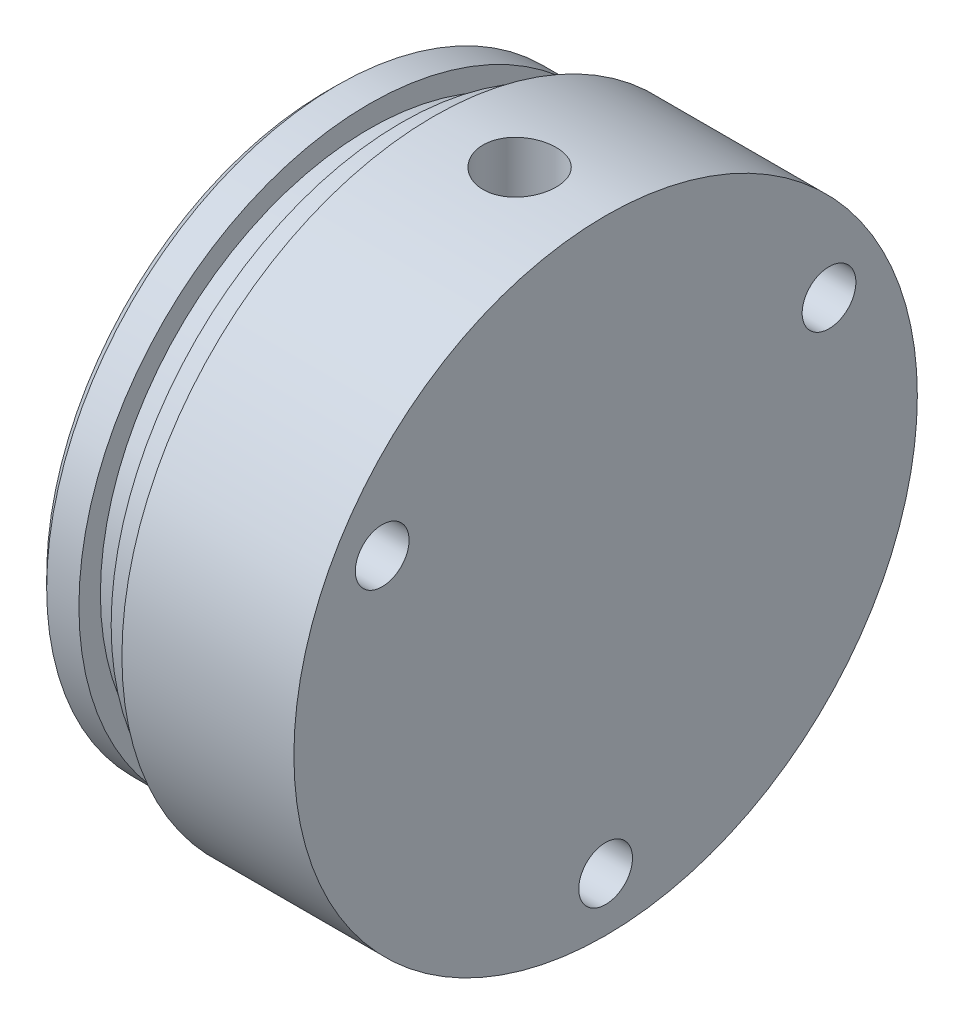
from build123d import *

# Parameters (mm, degrees)
R_P_TITION_CIRCULAIRE1_COUNT = 3
CHANFREIN1_SIZE              = 1
TROU_TARAUD_M82_D            = 6.8
TROU_TARAUD_M82_DEPTH        = 20
TROU_TARAUD_M82_TIP          = 2.042926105
D_GAGEMENT_M51_D             = 5.5
D_GAGEMENT_M51_DEPTH         = 22
D_GAGEMENT_M51_TIP           = 1.652366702


with BuildPart() as part:
    # Esquisse1 → R_volution1 (revolve)
    with BuildSketch(Plane.XY, mode=Mode.PRIVATE) as r_volution1_sk:
        Polygon((0, 0), (0, 27), (4, 27), (4, 25), (7, 25), (7, 27), (10, 27), (10, 29), (26, 29), (26, 0), align=None)
    revolve(r_volution1_sk.sketch.rotate(Axis((-46.067916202, 0, 0), (1, 0, 0)), 90), axis=Axis((-46.067916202, 0, 0), (1, 0, 0)))

    # Esquisse2 → Trou taraud_ M61 (revolve, cut)
    with BuildSketch(Plane(origin=(26, -24, 0), x_dir=(0, 0, -1), z_dir=(0, 1, 0))):
        Polygon((0, 0), (0, 18.502151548), (2.5, 17), (2.5, 0), align=None)
    trou_taraud_m61 = revolve(axis=Axis((32.35, -24, 0), (-1, 0, 0)), mode=Mode.SUBTRACT)

    # R_p_tition circulaire1: Trou taraud_ M61 ×3 about axis
    r_p_tition_circulaire1_axis = Axis((0, 0, 0), (1, 0, 0))
    for i in range(1, R_P_TITION_CIRCULAIRE1_COUNT):
        add(trou_taraud_m61.rotate(r_p_tition_circulaire1_axis, i * 360 / R_P_TITION_CIRCULAIRE1_COUNT), mode=Mode.SUBTRACT)

    # Chanfrein1
    chanfrein1_edges = [part.edges().sort_by_distance(p)[0] for p in [
        (0, 0, -27),
    ]]
    chamfer(chanfrein1_edges, length=CHANFREIN1_SIZE)

    # Trou taraud_ M82
    with Locations(Plane(origin=(18, 29, 0), x_dir=(0, 0, 1), z_dir=(0, 1, 0))):
        with Locations((0, 0)):
            Hole(TROU_TARAUD_M82_D / 2, depth=TROU_TARAUD_M82_DEPTH)
            with Locations((0, 0, -(TROU_TARAUD_M82_DEPTH + TROU_TARAUD_M82_TIP / 2))):  # 118° drill point
                Cone(0, TROU_TARAUD_M82_D / 2, TROU_TARAUD_M82_TIP, mode=Mode.SUBTRACT)

    # D_gagement M51
    with Locations(Plane.ZY):
        with Locations((0, 12)):
            Hole(D_GAGEMENT_M51_D / 2, depth=D_GAGEMENT_M51_DEPTH)
            with Locations((0, 0, -(D_GAGEMENT_M51_DEPTH + D_GAGEMENT_M51_TIP / 2))):  # 118° drill point
                Cone(0, D_GAGEMENT_M51_D / 2, D_GAGEMENT_M51_TIP, mode=Mode.SUBTRACT)


solid = part.part
